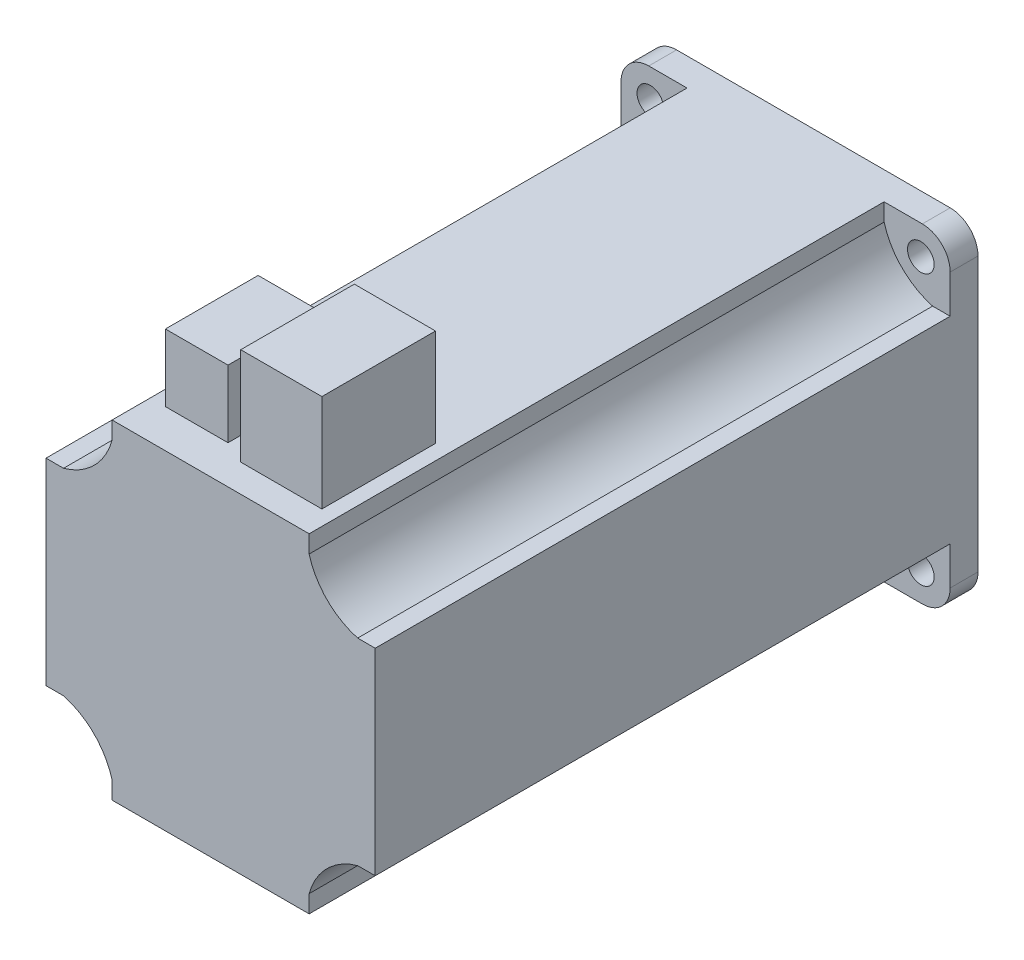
ISO-10303-21;
HEADER;
FILE_DESCRIPTION(('STEP AP214'),'2;1');
FILE_NAME('part.step','',(''),(''),'','','');
FILE_SCHEMA(('AUTOMOTIVE_DESIGN { 1 0 10303 214 1 1 1 1 }'));
ENDSEC;
DATA;
#1=APPLICATION_CONTEXT('core data for automotive mechanical design processes');
#2=APPLICATION_PROTOCOL_DEFINITION('international standard','automotive_design',2000,#1);
#3=PRODUCT_CONTEXT('',#1,'mechanical');
#4=PRODUCT('Part','Part','',(#3));
#5=PRODUCT_RELATED_PRODUCT_CATEGORY('part','',(#4));
#6=PRODUCT_DEFINITION_FORMATION('','',#4);
#7=PRODUCT_DEFINITION_CONTEXT('part definition',#1,'design');
#8=PRODUCT_DEFINITION('design','',#6,#7);
#9=PRODUCT_DEFINITION_SHAPE('','',#8);
#10=(LENGTH_UNIT() NAMED_UNIT(*) SI_UNIT(.MILLI.,.METRE.));
#11=(NAMED_UNIT(*) PLANE_ANGLE_UNIT() SI_UNIT($,.RADIAN.));
#12=(NAMED_UNIT(*) SI_UNIT($,.STERADIAN.) SOLID_ANGLE_UNIT());
#13=UNCERTAINTY_MEASURE_WITH_UNIT(LENGTH_MEASURE(1.E-05),#10,'distance_accuracy_value','');
#14=(GEOMETRIC_REPRESENTATION_CONTEXT(3) GLOBAL_UNCERTAINTY_ASSIGNED_CONTEXT((#13)) GLOBAL_UNIT_ASSIGNED_CONTEXT((#10,
#11,#12)) REPRESENTATION_CONTEXT('',''));
#15=CARTESIAN_POINT('',(0.,0.,0.));
#16=DIRECTION('',(0.,0.,1.));
#17=DIRECTION('',(1.,0.,0.));
#18=AXIS2_PLACEMENT_3D('',#15,#16,#17);
#19=CARTESIAN_POINT('',(-59.,71.,260.));
#20=DIRECTION('',(0.,-1.,0.));
#21=DIRECTION('',(1.,0.,0.));
#22=AXIS2_PLACEMENT_3D('',#19,#20,#21);
#23=PLANE('',#22);
#24=DIRECTION('',(0.,0.,-1.));
#25=VECTOR('',#24,1.);
#26=CARTESIAN_POINT('',(35.9999999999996,71.,199.));
#27=LINE('',#26,#25);
#28=CARTESIAN_POINT('',(35.9999999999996,71.,248.));
#29=VERTEX_POINT('',#28);
#30=CARTESIAN_POINT('',(35.9999999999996,71.,199.));
#31=VERTEX_POINT('',#30);
#32=EDGE_CURVE('E264',#29,#31,#27,.T.);
#33=ORIENTED_EDGE('',*,*,#32,.F.);
#34=DIRECTION('',(1.,0.,0.));
#35=VECTOR('',#34,1.);
#36=CARTESIAN_POINT('',(35.9999999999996,71.,248.));
#37=LINE('',#36,#35);
#38=CARTESIAN_POINT('',(0.99999999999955,71.,248.));
#39=VERTEX_POINT('',#38);
#40=EDGE_CURVE('E279',#39,#29,#37,.T.);
#41=ORIENTED_EDGE('',*,*,#40,.F.);
#42=DIRECTION('',(0.,0.,1.));
#43=VECTOR('',#42,1.);
#44=CARTESIAN_POINT('',(0.999999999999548,71.,199.));
#45=LINE('',#44,#43);
#46=CARTESIAN_POINT('',(0.99999999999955,71.,199.));
#47=VERTEX_POINT('',#46);
#48=EDGE_CURVE('E276',#47,#39,#45,.T.);
#49=ORIENTED_EDGE('',*,*,#48,.F.);
#50=DIRECTION('',(-1.,0.,0.));
#51=VECTOR('',#50,1.);
#52=CARTESIAN_POINT('',(35.9999999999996,71.,199.));
#53=LINE('',#52,#51);
#54=EDGE_CURVE('E268',#31,#47,#53,.T.);
#55=ORIENTED_EDGE('',*,*,#54,.F.);
#56=EDGE_LOOP('',(#33,#41,#49,#55));
#57=FACE_BOUND('',#56,.T.);
#58=DIRECTION('',(0.,0.,-1.));
#59=VECTOR('',#58,1.);
#60=CARTESIAN_POINT('',(42.4999999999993,71.,260.));
#61=LINE('',#60,#59);
#62=CARTESIAN_POINT('',(42.4999999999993,71.,260.));
#63=VERTEX_POINT('',#62);
#64=CARTESIAN_POINT('',(42.4999999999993,71.,12.));
#65=VERTEX_POINT('',#64);
#66=EDGE_CURVE('E331',#63,#65,#61,.T.);
#67=ORIENTED_EDGE('',*,*,#66,.T.);
#68=DIRECTION('',(-1.,0.,0.));
#69=VECTOR('',#68,1.);
#70=CARTESIAN_POINT('',(58.9999999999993,71.,12.));
#71=LINE('',#70,#69);
#72=CARTESIAN_POINT('',(58.9999999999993,71.,12.));
#73=VERTEX_POINT('',#72);
#74=EDGE_CURVE('E318',#73,#65,#71,.T.);
#75=ORIENTED_EDGE('',*,*,#74,.F.);
#76=DIRECTION('',(0.,0.,-1.));
#77=VECTOR('',#76,1.);
#78=CARTESIAN_POINT('',(59.,71.,260.));
#79=LINE('',#78,#77);
#80=CARTESIAN_POINT('',(59.,71.,0.));
#81=VERTEX_POINT('',#80);
#82=EDGE_CURVE('E480',#73,#81,#79,.T.);
#83=ORIENTED_EDGE('',*,*,#82,.T.);
#84=DIRECTION('',(-1.,0.,0.));
#85=VECTOR('',#84,1.);
#86=CARTESIAN_POINT('',(-59.,71.,0.));
#87=LINE('',#86,#85);
#88=CARTESIAN_POINT('',(-59.,71.,0.));
#89=VERTEX_POINT('',#88);
#90=EDGE_CURVE('E464',#81,#89,#87,.T.);
#91=ORIENTED_EDGE('',*,*,#90,.T.);
#92=DIRECTION('',(0.,0.,-1.));
#93=VECTOR('',#92,1.);
#94=CARTESIAN_POINT('',(-59.,71.,260.));
#95=LINE('',#94,#93);
#96=CARTESIAN_POINT('',(-59.,71.,12.));
#97=VERTEX_POINT('',#96);
#98=EDGE_CURVE('E478',#97,#89,#95,.T.);
#99=ORIENTED_EDGE('',*,*,#98,.F.);
#100=DIRECTION('',(-1.,0.,0.));
#101=VECTOR('',#100,1.);
#102=CARTESIAN_POINT('',(-42.5,71.,12.));
#103=LINE('',#102,#101);
#104=CARTESIAN_POINT('',(-42.5,71.,12.));
#105=VERTEX_POINT('',#104);
#106=EDGE_CURVE('E407',#105,#97,#103,.T.);
#107=ORIENTED_EDGE('',*,*,#106,.F.);
#108=DIRECTION('',(0.,0.,-1.));
#109=VECTOR('',#108,1.);
#110=CARTESIAN_POINT('',(-42.5,71.,260.));
#111=LINE('',#110,#109);
#112=CARTESIAN_POINT('',(-42.5,71.,260.));
#113=VERTEX_POINT('',#112);
#114=EDGE_CURVE('E428',#113,#105,#111,.T.);
#115=ORIENTED_EDGE('',*,*,#114,.F.);
#116=DIRECTION('',(-1.,0.,0.));
#117=VECTOR('',#116,1.);
#118=CARTESIAN_POINT('',(-59.,71.,260.));
#119=LINE('',#118,#117);
#120=EDGE_CURVE('E476',#63,#113,#119,.T.);
#121=ORIENTED_EDGE('',*,*,#120,.F.);
#122=EDGE_LOOP('',(#67,#75,#83,#91,#99,#107,#115,#121));
#123=FACE_BOUND('',#122,.T.);
#124=DIRECTION('',(0.,0.,-1.));
#125=VECTOR('',#124,1.);
#126=CARTESIAN_POINT('',(-9.,71.,243.5));
#127=LINE('',#126,#125);
#128=CARTESIAN_POINT('',(-9.,71.,243.5));
#129=VERTEX_POINT('',#128);
#130=CARTESIAN_POINT('',(-9.,71.,213.));
#131=VERTEX_POINT('',#130);
#132=EDGE_CURVE('E248',#129,#131,#127,.T.);
#133=ORIENTED_EDGE('',*,*,#132,.F.);
#134=DIRECTION('',(1.,0.,0.));
#135=VECTOR('',#134,1.);
#136=CARTESIAN_POINT('',(-9.,71.,243.5));
#137=LINE('',#136,#135);
#138=CARTESIAN_POINT('',(-36.,71.,243.5));
#139=VERTEX_POINT('',#138);
#140=EDGE_CURVE('E1007',#139,#129,#137,.T.);
#141=ORIENTED_EDGE('',*,*,#140,.F.);
#142=DIRECTION('',(0.,0.,1.));
#143=VECTOR('',#142,1.);
#144=CARTESIAN_POINT('',(-36.,71.,243.5));
#145=LINE('',#144,#143);
#146=CARTESIAN_POINT('',(-36.,71.,213.));
#147=VERTEX_POINT('',#146);
#148=EDGE_CURVE('E37',#147,#139,#145,.T.);
#149=ORIENTED_EDGE('',*,*,#148,.F.);
#150=DIRECTION('',(-1.,0.,0.));
#151=VECTOR('',#150,1.);
#152=CARTESIAN_POINT('',(71.001,71.,213.));
#153=LINE('',#152,#151);
#154=EDGE_CURVE('E1000',#131,#147,#153,.T.);
#155=ORIENTED_EDGE('',*,*,#154,.F.);
#156=EDGE_LOOP('',(#133,#141,#149,#155));
#157=FACE_BOUND('',#156,.T.);
#158=ADVANCED_FACE('F15',(#57,#123,#157),#23,.F.);
#159=CARTESIAN_POINT('',(-59.,59.,260.));
#160=DIRECTION('',(0.,0.,-1.));
#161=DIRECTION('',(-1.,0.,0.));
#162=AXIS2_PLACEMENT_3D('',#159,#160,#161);
#163=PLANE('',#162);
#164=DIRECTION('',(1.,0.,0.));
#165=VECTOR('',#164,1.);
#166=CARTESIAN_POINT('',(71.,42.5000000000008,260.));
#167=LINE('',#166,#165);
#168=CARTESIAN_POINT('',(63.4326915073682,42.5000000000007,260.));
#169=VERTEX_POINT('',#168);
#170=CARTESIAN_POINT('',(71.,42.5000000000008,260.));
#171=VERTEX_POINT('',#170);
#172=EDGE_CURVE('E324',#169,#171,#167,.T.);
#173=ORIENTED_EDGE('',*,*,#172,.F.);
#174=CARTESIAN_POINT('',(71.4177848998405,71.4177848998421,260.));
#175=DIRECTION('',(0.,0.,1.));
#176=DIRECTION('',(0.,-1.,0.));
#177=AXIS2_PLACEMENT_3D('',#174,#175,#176);
#178=CIRCLE('',#177,30.);
#179=CARTESIAN_POINT('',(42.4999999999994,63.4326915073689,260.));
#180=VERTEX_POINT('',#179);
#181=EDGE_CURVE('E322',#180,#169,#178,.T.);
#182=ORIENTED_EDGE('',*,*,#181,.F.);
#183=DIRECTION('',(0.,-1.,0.));
#184=VECTOR('',#183,1.);
#185=CARTESIAN_POINT('',(42.4999999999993,71.,260.));
#186=LINE('',#185,#184);
#187=EDGE_CURVE('E326',#63,#180,#186,.T.);
#188=ORIENTED_EDGE('',*,*,#187,.F.);
#189=ORIENTED_EDGE('',*,*,#120,.T.);
#190=DIRECTION('',(0.,1.,0.));
#191=VECTOR('',#190,1.);
#192=CARTESIAN_POINT('',(-42.5,71.,260.));
#193=LINE('',#192,#191);
#194=CARTESIAN_POINT('',(-42.5,63.4326915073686,260.));
#195=VERTEX_POINT('',#194);
#196=EDGE_CURVE('E417',#195,#113,#193,.T.);
#197=ORIENTED_EDGE('',*,*,#196,.F.);
#198=CARTESIAN_POINT('',(-71.4177848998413,71.4177848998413,260.));
#199=DIRECTION('',(0.,0.,1.));
#200=DIRECTION('',(1.,0.,0.));
#201=AXIS2_PLACEMENT_3D('',#198,#199,#200);
#202=CIRCLE('',#201,30.);
#203=CARTESIAN_POINT('',(-63.4326915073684,42.5,260.));
#204=VERTEX_POINT('',#203);
#205=EDGE_CURVE('E415',#204,#195,#202,.T.);
#206=ORIENTED_EDGE('',*,*,#205,.F.);
#207=DIRECTION('',(1.,0.,0.));
#208=VECTOR('',#207,1.);
#209=CARTESIAN_POINT('',(-71.,42.5,260.));
#210=LINE('',#209,#208);
#211=CARTESIAN_POINT('',(-71.,42.5,260.));
#212=VERTEX_POINT('',#211);
#213=EDGE_CURVE('E420',#212,#204,#210,.T.);
#214=ORIENTED_EDGE('',*,*,#213,.F.);
#215=DIRECTION('',(0.,-1.,0.));
#216=VECTOR('',#215,1.);
#217=CARTESIAN_POINT('',(-71.,59.,260.));
#218=LINE('',#217,#216);
#219=CARTESIAN_POINT('',(-71.,-42.5,260.));
#220=VERTEX_POINT('',#219);
#221=EDGE_CURVE('E467',#212,#220,#218,.T.);
#222=ORIENTED_EDGE('',*,*,#221,.T.);
#223=DIRECTION('',(-1.,0.,0.));
#224=VECTOR('',#223,1.);
#225=CARTESIAN_POINT('',(-71.,-42.5,260.));
#226=LINE('',#225,#224);
#227=CARTESIAN_POINT('',(-63.4326915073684,-42.5,260.));
#228=VERTEX_POINT('',#227);
#229=EDGE_CURVE('E386',#228,#220,#226,.T.);
#230=ORIENTED_EDGE('',*,*,#229,.F.);
#231=CARTESIAN_POINT('',(-71.417784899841,-71.4177848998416,260.));
#232=DIRECTION('',(0.,0.,1.));
#233=DIRECTION('',(0.,1.,0.));
#234=AXIS2_PLACEMENT_3D('',#231,#232,#233);
#235=CIRCLE('',#234,30.);
#236=CARTESIAN_POINT('',(-42.5,-63.4326915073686,260.));
#237=VERTEX_POINT('',#236);
#238=EDGE_CURVE('E384',#237,#228,#235,.T.);
#239=ORIENTED_EDGE('',*,*,#238,.F.);
#240=DIRECTION('',(0.,1.,0.));
#241=VECTOR('',#240,1.);
#242=CARTESIAN_POINT('',(-42.5,-71.,260.));
#243=LINE('',#242,#241);
#244=CARTESIAN_POINT('',(-42.5,-71.,260.));
#245=VERTEX_POINT('',#244);
#246=EDGE_CURVE('E388',#245,#237,#243,.T.);
#247=ORIENTED_EDGE('',*,*,#246,.F.);
#248=DIRECTION('',(1.,0.,0.));
#249=VECTOR('',#248,1.);
#250=CARTESIAN_POINT('',(-59.,-71.,260.));
#251=LINE('',#250,#249);
#252=CARTESIAN_POINT('',(42.5000000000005,-71.,260.));
#253=VERTEX_POINT('',#252);
#254=EDGE_CURVE('E470',#245,#253,#251,.T.);
#255=ORIENTED_EDGE('',*,*,#254,.T.);
#256=DIRECTION('',(0.,-1.,0.));
#257=VECTOR('',#256,1.);
#258=CARTESIAN_POINT('',(42.5000000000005,-71.,260.));
#259=LINE('',#258,#257);
#260=CARTESIAN_POINT('',(42.5000000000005,-63.4326915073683,260.));
#261=VERTEX_POINT('',#260);
#262=EDGE_CURVE('E355',#261,#253,#259,.T.);
#263=ORIENTED_EDGE('',*,*,#262,.F.);
#264=CARTESIAN_POINT('',(71.4177848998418,-71.4177848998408,260.));
#265=DIRECTION('',(0.,0.,1.));
#266=DIRECTION('',(-1.,0.,0.));
#267=AXIS2_PLACEMENT_3D('',#264,#265,#266);
#268=CIRCLE('',#267,30.);
#269=CARTESIAN_POINT('',(63.4326915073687,-42.5,260.));
#270=VERTEX_POINT('',#269);
#271=EDGE_CURVE('E353',#270,#261,#268,.T.);
#272=ORIENTED_EDGE('',*,*,#271,.F.);
#273=DIRECTION('',(-1.,0.,0.));
#274=VECTOR('',#273,1.);
#275=CARTESIAN_POINT('',(71.,-42.4999999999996,260.));
#276=LINE('',#275,#274);
#277=CARTESIAN_POINT('',(71.,-42.4999999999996,260.));
#278=VERTEX_POINT('',#277);
#279=EDGE_CURVE('E357',#278,#270,#276,.T.);
#280=ORIENTED_EDGE('',*,*,#279,.F.);
#281=DIRECTION('',(0.,1.,0.));
#282=VECTOR('',#281,1.);
#283=CARTESIAN_POINT('',(71.,59.,260.));
#284=LINE('',#283,#282);
#285=EDGE_CURVE('E473',#278,#171,#284,.T.);
#286=ORIENTED_EDGE('',*,*,#285,.T.);
#287=EDGE_LOOP('',(#173,#182,#188,#189,#197,#206,#214,#222,#230,#239,#247,#255,#263,#272,#280,#286));
#288=FACE_BOUND('',#287,.T.);
#289=ADVANCED_FACE('F551',(#288),#163,.F.);
#290=CARTESIAN_POINT('',(71.,59.,260.));
#291=DIRECTION('',(-1.,0.,0.));
#292=DIRECTION('',(0.,-1.,0.));
#293=AXIS2_PLACEMENT_3D('',#290,#291,#292);
#294=PLANE('',#293);
#295=DIRECTION('',(0.,0.,-1.));
#296=VECTOR('',#295,1.);
#297=CARTESIAN_POINT('',(71.,42.5000000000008,260.));
#298=LINE('',#297,#296);
#299=CARTESIAN_POINT('',(71.,42.5000000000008,12.));
#300=VERTEX_POINT('',#299);
#301=EDGE_CURVE('E334',#171,#300,#298,.T.);
#302=ORIENTED_EDGE('',*,*,#301,.F.);
#303=ORIENTED_EDGE('',*,*,#285,.F.);
#304=DIRECTION('',(0.,0.,-1.));
#305=VECTOR('',#304,1.);
#306=CARTESIAN_POINT('',(71.,-42.4999999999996,260.));
#307=LINE('',#306,#305);
#308=CARTESIAN_POINT('',(71.,-42.4999999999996,12.));
#309=VERTEX_POINT('',#308);
#310=EDGE_CURVE('E362',#278,#309,#307,.T.);
#311=ORIENTED_EDGE('',*,*,#310,.T.);
#312=DIRECTION('',(0.,1.,0.));
#313=VECTOR('',#312,1.);
#314=CARTESIAN_POINT('',(71.,-59.,12.));
#315=LINE('',#314,#313);
#316=CARTESIAN_POINT('',(71.,-59.,12.));
#317=VERTEX_POINT('',#316);
#318=EDGE_CURVE('E349',#317,#309,#315,.T.);
#319=ORIENTED_EDGE('',*,*,#318,.F.);
#320=DIRECTION('',(0.,0.,-1.));
#321=VECTOR('',#320,1.);
#322=CARTESIAN_POINT('',(71.,-59.,260.));
#323=LINE('',#322,#321);
#324=CARTESIAN_POINT('',(71.,-59.,0.));
#325=VERTEX_POINT('',#324);
#326=EDGE_CURVE('E484',#317,#325,#323,.T.);
#327=ORIENTED_EDGE('',*,*,#326,.T.);
#328=DIRECTION('',(0.,1.,0.));
#329=VECTOR('',#328,1.);
#330=CARTESIAN_POINT('',(71.,59.,0.));
#331=LINE('',#330,#329);
#332=CARTESIAN_POINT('',(71.,59.,0.));
#333=VERTEX_POINT('',#332);
#334=EDGE_CURVE('E458',#325,#333,#331,.T.);
#335=ORIENTED_EDGE('',*,*,#334,.T.);
#336=DIRECTION('',(0.,0.,-1.));
#337=VECTOR('',#336,1.);
#338=CARTESIAN_POINT('',(71.,59.,260.));
#339=LINE('',#338,#337);
#340=CARTESIAN_POINT('',(71.,59.,12.));
#341=VERTEX_POINT('',#340);
#342=EDGE_CURVE('E482',#341,#333,#339,.T.);
#343=ORIENTED_EDGE('',*,*,#342,.F.);
#344=DIRECTION('',(0.,1.,0.));
#345=VECTOR('',#344,1.);
#346=CARTESIAN_POINT('',(71.,42.5000000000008,12.));
#347=LINE('',#346,#345);
#348=EDGE_CURVE('E314',#300,#341,#347,.T.);
#349=ORIENTED_EDGE('',*,*,#348,.F.);
#350=EDGE_LOOP('',(#302,#303,#311,#319,#327,#335,#343,#349));
#351=FACE_BOUND('',#350,.T.);
#352=ADVANCED_FACE('F523',(#351),#294,.F.);
#353=CARTESIAN_POINT('',(59.,59.,260.));
#354=DIRECTION('',(0.,0.,-1.));
#355=DIRECTION('',(-1.,0.,0.));
#356=AXIS2_PLACEMENT_3D('',#353,#354,#355);
#357=CYLINDRICAL_SURFACE('',#356,12.);
#358=CARTESIAN_POINT('',(59.,59.,12.));
#359=DIRECTION('',(0.,0.,1.));
#360=DIRECTION('',(0.,-1.,0.));
#361=AXIS2_PLACEMENT_3D('',#358,#359,#360);
#362=CIRCLE('',#361,12.);
#363=EDGE_CURVE('E316',#341,#73,#362,.T.);
#364=ORIENTED_EDGE('',*,*,#363,.F.);
#365=ORIENTED_EDGE('',*,*,#342,.T.);
#366=CARTESIAN_POINT('',(59.,59.,0.));
#367=DIRECTION('',(0.,0.,1.));
#368=DIRECTION('',(-1.,0.,0.));
#369=AXIS2_PLACEMENT_3D('',#366,#367,#368);
#370=CIRCLE('',#369,12.);
#371=EDGE_CURVE('E461',#333,#81,#370,.T.);
#372=ORIENTED_EDGE('',*,*,#371,.T.);
#373=ORIENTED_EDGE('',*,*,#82,.F.);
#374=EDGE_LOOP('',(#364,#365,#372,#373));
#375=FACE_BOUND('',#374,.T.);
#376=ADVANCED_FACE('F518',(#375),#357,.T.);
#377=CARTESIAN_POINT('',(-59.,-71.,260.));
#378=DIRECTION('',(0.,1.,0.));
#379=DIRECTION('',(-1.,0.,0.));
#380=AXIS2_PLACEMENT_3D('',#377,#378,#379);
#381=PLANE('',#380);
#382=DIRECTION('',(0.,0.,-1.));
#383=VECTOR('',#382,1.);
#384=CARTESIAN_POINT('',(42.5000000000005,-71.,260.));
#385=LINE('',#384,#383);
#386=CARTESIAN_POINT('',(42.5000000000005,-71.,12.));
#387=VERTEX_POINT('',#386);
#388=EDGE_CURVE('E365',#253,#387,#385,.T.);
#389=ORIENTED_EDGE('',*,*,#388,.F.);
#390=ORIENTED_EDGE('',*,*,#254,.F.);
#391=DIRECTION('',(0.,0.,-1.));
#392=VECTOR('',#391,1.);
#393=CARTESIAN_POINT('',(-42.5,-71.,260.));
#394=LINE('',#393,#392);
#395=CARTESIAN_POINT('',(-42.5,-71.,12.));
#396=VERTEX_POINT('',#395);
#397=EDGE_CURVE('E393',#245,#396,#394,.T.);
#398=ORIENTED_EDGE('',*,*,#397,.T.);
#399=DIRECTION('',(1.,0.,0.));
#400=VECTOR('',#399,1.);
#401=CARTESIAN_POINT('',(-59.,-71.,12.));
#402=LINE('',#401,#400);
#403=CARTESIAN_POINT('',(-59.,-71.,12.));
#404=VERTEX_POINT('',#403);
#405=EDGE_CURVE('E380',#404,#396,#402,.T.);
#406=ORIENTED_EDGE('',*,*,#405,.F.);
#407=DIRECTION('',(0.,0.,-1.));
#408=VECTOR('',#407,1.);
#409=CARTESIAN_POINT('',(-59.,-71.,260.));
#410=LINE('',#409,#408);
#411=CARTESIAN_POINT('',(-59.,-71.,0.));
#412=VERTEX_POINT('',#411);
#413=EDGE_CURVE('E488',#404,#412,#410,.T.);
#414=ORIENTED_EDGE('',*,*,#413,.T.);
#415=DIRECTION('',(1.,0.,0.));
#416=VECTOR('',#415,1.);
#417=CARTESIAN_POINT('',(-59.,-71.,0.));
#418=LINE('',#417,#416);
#419=CARTESIAN_POINT('',(59.,-71.,0.));
#420=VERTEX_POINT('',#419);
#421=EDGE_CURVE('E452',#412,#420,#418,.T.);
#422=ORIENTED_EDGE('',*,*,#421,.T.);
#423=DIRECTION('',(0.,0.,-1.));
#424=VECTOR('',#423,1.);
#425=CARTESIAN_POINT('',(59.,-71.,260.));
#426=LINE('',#425,#424);
#427=CARTESIAN_POINT('',(59.,-71.,12.));
#428=VERTEX_POINT('',#427);
#429=EDGE_CURVE('E486',#428,#420,#426,.T.);
#430=ORIENTED_EDGE('',*,*,#429,.F.);
#431=DIRECTION('',(1.,0.,0.));
#432=VECTOR('',#431,1.);
#433=CARTESIAN_POINT('',(42.5000000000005,-71.,12.));
#434=LINE('',#433,#432);
#435=EDGE_CURVE('E345',#387,#428,#434,.T.);
#436=ORIENTED_EDGE('',*,*,#435,.F.);
#437=EDGE_LOOP('',(#389,#390,#398,#406,#414,#422,#430,#436));
#438=FACE_BOUND('',#437,.T.);
#439=ADVANCED_FACE('F532',(#438),#381,.F.);
#440=CARTESIAN_POINT('',(59.,-59.,260.));
#441=DIRECTION('',(0.,0.,-1.));
#442=DIRECTION('',(-1.,0.,0.));
#443=AXIS2_PLACEMENT_3D('',#440,#441,#442);
#444=CYLINDRICAL_SURFACE('',#443,12.);
#445=CARTESIAN_POINT('',(59.,-59.,12.));
#446=DIRECTION('',(0.,0.,1.));
#447=DIRECTION('',(-1.,0.,0.));
#448=AXIS2_PLACEMENT_3D('',#445,#446,#447);
#449=CIRCLE('',#448,12.);
#450=EDGE_CURVE('E347',#428,#317,#449,.T.);
#451=ORIENTED_EDGE('',*,*,#450,.F.);
#452=ORIENTED_EDGE('',*,*,#429,.T.);
#453=CARTESIAN_POINT('',(59.,-59.,0.));
#454=DIRECTION('',(0.,0.,1.));
#455=DIRECTION('',(-1.,0.,0.));
#456=AXIS2_PLACEMENT_3D('',#453,#454,#455);
#457=CIRCLE('',#456,12.);
#458=EDGE_CURVE('E455',#420,#325,#457,.T.);
#459=ORIENTED_EDGE('',*,*,#458,.T.);
#460=ORIENTED_EDGE('',*,*,#326,.F.);
#461=EDGE_LOOP('',(#451,#452,#459,#460));
#462=FACE_BOUND('',#461,.T.);
#463=ADVANCED_FACE('F528',(#462),#444,.T.);
#464=CARTESIAN_POINT('',(-71.,59.,260.));
#465=DIRECTION('',(1.,0.,0.));
#466=DIRECTION('',(0.,0.,-1.));
#467=AXIS2_PLACEMENT_3D('',#464,#465,#466);
#468=PLANE('',#467);
#469=DIRECTION('',(0.,0.,-1.));
#470=VECTOR('',#469,1.);
#471=CARTESIAN_POINT('',(-71.,-42.5,260.));
#472=LINE('',#471,#470);
#473=CARTESIAN_POINT('',(-71.,-42.5,12.));
#474=VERTEX_POINT('',#473);
#475=EDGE_CURVE('E396',#220,#474,#472,.T.);
#476=ORIENTED_EDGE('',*,*,#475,.F.);
#477=ORIENTED_EDGE('',*,*,#221,.F.);
#478=DIRECTION('',(0.,0.,-1.));
#479=VECTOR('',#478,1.);
#480=CARTESIAN_POINT('',(-71.,42.5,260.));
#481=LINE('',#480,#479);
#482=CARTESIAN_POINT('',(-71.,42.5,12.));
#483=VERTEX_POINT('',#482);
#484=EDGE_CURVE('E425',#212,#483,#481,.T.);
#485=ORIENTED_EDGE('',*,*,#484,.T.);
#486=DIRECTION('',(0.,-1.,0.));
#487=VECTOR('',#486,1.);
#488=CARTESIAN_POINT('',(-71.,59.,12.));
#489=LINE('',#488,#487);
#490=CARTESIAN_POINT('',(-71.,59.,12.));
#491=VERTEX_POINT('',#490);
#492=EDGE_CURVE('E411',#491,#483,#489,.T.);
#493=ORIENTED_EDGE('',*,*,#492,.F.);
#494=DIRECTION('',(0.,0.,-1.));
#495=VECTOR('',#494,1.);
#496=CARTESIAN_POINT('',(-71.,59.,260.));
#497=LINE('',#496,#495);
#498=CARTESIAN_POINT('',(-71.,59.,0.));
#499=VERTEX_POINT('',#498);
#500=EDGE_CURVE('E23',#491,#499,#497,.T.);
#501=ORIENTED_EDGE('',*,*,#500,.T.);
#502=DIRECTION('',(0.,-1.,0.));
#503=VECTOR('',#502,1.);
#504=CARTESIAN_POINT('',(-71.,59.,0.));
#505=LINE('',#504,#503);
#506=CARTESIAN_POINT('',(-71.,-59.,0.));
#507=VERTEX_POINT('',#506);
#508=EDGE_CURVE('E446',#499,#507,#505,.T.);
#509=ORIENTED_EDGE('',*,*,#508,.T.);
#510=DIRECTION('',(0.,0.,-1.));
#511=VECTOR('',#510,1.);
#512=CARTESIAN_POINT('',(-71.,-59.,260.));
#513=LINE('',#512,#511);
#514=CARTESIAN_POINT('',(-71.,-59.,12.));
#515=VERTEX_POINT('',#514);
#516=EDGE_CURVE('E490',#515,#507,#513,.T.);
#517=ORIENTED_EDGE('',*,*,#516,.F.);
#518=DIRECTION('',(0.,-1.,0.));
#519=VECTOR('',#518,1.);
#520=CARTESIAN_POINT('',(-71.,-42.5,12.));
#521=LINE('',#520,#519);
#522=EDGE_CURVE('E376',#474,#515,#521,.T.);
#523=ORIENTED_EDGE('',*,*,#522,.F.);
#524=EDGE_LOOP('',(#476,#477,#485,#493,#501,#509,#517,#523));
#525=FACE_BOUND('',#524,.T.);
#526=ADVANCED_FACE('F496',(#525),#468,.F.);
#527=CARTESIAN_POINT('',(-59.,-59.,260.));
#528=DIRECTION('',(0.,0.,-1.));
#529=DIRECTION('',(-1.,0.,0.));
#530=AXIS2_PLACEMENT_3D('',#527,#528,#529);
#531=CYLINDRICAL_SURFACE('',#530,12.);
#532=CARTESIAN_POINT('',(-59.,-59.,12.));
#533=DIRECTION('',(0.,0.,1.));
#534=DIRECTION('',(0.,1.,0.));
#535=AXIS2_PLACEMENT_3D('',#532,#533,#534);
#536=CIRCLE('',#535,12.);
#537=EDGE_CURVE('E378',#515,#404,#536,.T.);
#538=ORIENTED_EDGE('',*,*,#537,.F.);
#539=ORIENTED_EDGE('',*,*,#516,.T.);
#540=CARTESIAN_POINT('',(-59.,-59.,0.));
#541=DIRECTION('',(0.,0.,1.));
#542=DIRECTION('',(-1.,0.,0.));
#543=AXIS2_PLACEMENT_3D('',#540,#541,#542);
#544=CIRCLE('',#543,12.);
#545=EDGE_CURVE('E449',#507,#412,#544,.T.);
#546=ORIENTED_EDGE('',*,*,#545,.T.);
#547=ORIENTED_EDGE('',*,*,#413,.F.);
#548=EDGE_LOOP('',(#538,#539,#546,#547));
#549=FACE_BOUND('',#548,.T.);
#550=ADVANCED_FACE('F538',(#549),#531,.T.);
#551=CARTESIAN_POINT('',(-59.,59.,260.));
#552=DIRECTION('',(0.,0.,-1.));
#553=DIRECTION('',(-1.,0.,0.));
#554=AXIS2_PLACEMENT_3D('',#551,#552,#553);
#555=CYLINDRICAL_SURFACE('',#554,12.);
#556=CARTESIAN_POINT('',(-59.,59.,12.));
#557=DIRECTION('',(0.,0.,1.));
#558=DIRECTION('',(1.,0.,0.));
#559=AXIS2_PLACEMENT_3D('',#556,#557,#558);
#560=CIRCLE('',#559,12.);
#561=EDGE_CURVE('E409',#97,#491,#560,.T.);
#562=ORIENTED_EDGE('',*,*,#561,.F.);
#563=ORIENTED_EDGE('',*,*,#98,.T.);
#564=CARTESIAN_POINT('',(-59.,59.,0.));
#565=DIRECTION('',(0.,0.,1.));
#566=DIRECTION('',(-1.,0.,0.));
#567=AXIS2_PLACEMENT_3D('',#564,#565,#566);
#568=CIRCLE('',#567,12.);
#569=EDGE_CURVE('E443',#89,#499,#568,.T.);
#570=ORIENTED_EDGE('',*,*,#569,.T.);
#571=ORIENTED_EDGE('',*,*,#500,.F.);
#572=EDGE_LOOP('',(#562,#563,#570,#571));
#573=FACE_BOUND('',#572,.T.);
#574=ADVANCED_FACE('F17',(#573),#555,.T.);
#575=CARTESIAN_POINT('',(-59.,59.,0.));
#576=DIRECTION('',(0.,0.,-1.));
#577=DIRECTION('',(-1.,0.,0.));
#578=AXIS2_PLACEMENT_3D('',#575,#576,#577);
#579=PLANE('',#578);
#580=CARTESIAN_POINT('',(0.,0.,0.));
#581=DIRECTION('',(0.,0.,-1.));
#582=DIRECTION('',(-1.,0.,0.));
#583=AXIS2_PLACEMENT_3D('',#580,#581,#582);
#584=CIRCLE('',#583,60.);
#585=CARTESIAN_POINT('',(-60.,0.,0.));
#586=VERTEX_POINT('',#585);
#587=EDGE_CURVE('E10',#586,#586,#584,.F.);
#588=ORIENTED_EDGE('',*,*,#587,.F.);
#589=EDGE_LOOP('',(#588));
#590=FACE_BOUND('',#589,.T.);
#591=ADVANCED_FACE('F655',(#590),#579,.T.);
#592=CARTESIAN_POINT('',(58.3363094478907,-58.3363094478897,0.));
#593=DIRECTION('',(0.,0.,-1.));
#594=DIRECTION('',(-1.,0.,0.));
#595=AXIS2_PLACEMENT_3D('',#592,#593,#594);
#596=CIRCLE('',#595,5.75);
#597=CARTESIAN_POINT('',(52.5863094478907,-58.3363094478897,0.));
#598=VERTEX_POINT('',#597);
#599=EDGE_CURVE('E981',#598,#598,#596,.T.);
#600=ORIENTED_EDGE('',*,*,#599,.F.);
#601=EDGE_LOOP('',(#600));
#602=FACE_BOUND('',#601,.T.);
#603=CARTESIAN_POINT('',(-58.3363094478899,-58.3363094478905,0.));
#604=DIRECTION('',(0.,0.,-1.));
#605=DIRECTION('',(-1.,0.,0.));
#606=AXIS2_PLACEMENT_3D('',#603,#604,#605);
#607=CIRCLE('',#606,5.75);
#608=CARTESIAN_POINT('',(-64.0863094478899,-58.3363094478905,0.));
#609=VERTEX_POINT('',#608);
#610=EDGE_CURVE('E985',#609,#609,#607,.T.);
#611=ORIENTED_EDGE('',*,*,#610,.F.);
#612=EDGE_LOOP('',(#611));
#613=FACE_BOUND('',#612,.T.);
#614=CARTESIAN_POINT('',(-58.3363094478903,58.3363094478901,0.));
#615=DIRECTION('',(0.,0.,-1.));
#616=DIRECTION('',(-1.,0.,0.));
#617=AXIS2_PLACEMENT_3D('',#614,#615,#616);
#618=CIRCLE('',#617,5.75);
#619=CARTESIAN_POINT('',(-64.0863094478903,58.3363094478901,0.));
#620=VERTEX_POINT('',#619);
#621=EDGE_CURVE('E994',#620,#620,#618,.T.);
#622=ORIENTED_EDGE('',*,*,#621,.F.);
#623=EDGE_LOOP('',(#622));
#624=FACE_BOUND('',#623,.T.);
#625=CARTESIAN_POINT('',(58.3363094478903,58.3363094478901,0.));
#626=DIRECTION('',(0.,0.,-1.));
#627=DIRECTION('',(-1.,0.,0.));
#628=AXIS2_PLACEMENT_3D('',#625,#626,#627);
#629=CIRCLE('',#628,5.75);
#630=CARTESIAN_POINT('',(52.5863094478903,58.3363094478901,0.));
#631=VERTEX_POINT('',#630);
#632=EDGE_CURVE('E303',#631,#631,#629,.T.);
#633=ORIENTED_EDGE('',*,*,#632,.F.);
#634=EDGE_LOOP('',(#633));
#635=FACE_BOUND('',#634,.T.);
#636=ORIENTED_EDGE('',*,*,#569,.F.);
#637=ORIENTED_EDGE('',*,*,#90,.F.);
#638=ORIENTED_EDGE('',*,*,#371,.F.);
#639=ORIENTED_EDGE('',*,*,#334,.F.);
#640=ORIENTED_EDGE('',*,*,#458,.F.);
#641=ORIENTED_EDGE('',*,*,#421,.F.);
#642=ORIENTED_EDGE('',*,*,#545,.F.);
#643=ORIENTED_EDGE('',*,*,#508,.F.);
#644=EDGE_LOOP('',(#636,#637,#638,#639,#640,#641,#642,#643));
#645=FACE_BOUND('',#644,.T.);
#646=CARTESIAN_POINT('',(0.,0.,0.));
#647=DIRECTION('',(0.,0.,-1.));
#648=DIRECTION('',(-1.,0.,0.));
#649=AXIS2_PLACEMENT_3D('',#646,#647,#648);
#650=CIRCLE('',#649,65.);
#651=CARTESIAN_POINT('',(-65.,0.,0.));
#652=VERTEX_POINT('',#651);
#653=EDGE_CURVE('E437',#652,#652,#650,.T.);
#654=ORIENTED_EDGE('',*,*,#653,.F.);
#655=EDGE_LOOP('',(#654));
#656=FACE_BOUND('',#655,.T.);
#657=ADVANCED_FACE('F503',(#602,#613,#624,#635,#645,#656),#579,.T.);
#658=CARTESIAN_POINT('',(0.,0.,-3.5));
#659=DIRECTION('',(0.,0.,-1.));
#660=DIRECTION('',(-1.,0.,0.));
#661=AXIS2_PLACEMENT_3D('',#658,#659,#660);
#662=PLANE('',#661);
#663=CARTESIAN_POINT('',(0.,0.,-3.5));
#664=DIRECTION('',(0.,0.,-1.));
#665=DIRECTION('',(-1.,0.,0.));
#666=AXIS2_PLACEMENT_3D('',#663,#664,#665);
#667=CIRCLE('',#666,65.);
#668=CARTESIAN_POINT('',(-65.,0.,-3.5));
#669=VERTEX_POINT('',#668);
#670=EDGE_CURVE('E440',#669,#669,#667,.T.);
#671=ORIENTED_EDGE('',*,*,#670,.T.);
#672=EDGE_LOOP('',(#671));
#673=FACE_BOUND('',#672,.T.);
#674=CARTESIAN_POINT('',(0.,0.,-3.5));
#675=DIRECTION('',(0.,0.,-1.));
#676=DIRECTION('',(-1.,0.,0.));
#677=AXIS2_PLACEMENT_3D('',#674,#675,#676);
#678=CIRCLE('',#677,60.);
#679=CARTESIAN_POINT('',(-60.,0.,-3.5));
#680=VERTEX_POINT('',#679);
#681=EDGE_CURVE('E434',#680,#680,#678,.T.);
#682=ORIENTED_EDGE('',*,*,#681,.F.);
#683=EDGE_LOOP('',(#682));
#684=FACE_BOUND('',#683,.T.);
#685=ADVANCED_FACE('F669',(#673,#684),#662,.T.);
#686=CARTESIAN_POINT('',(0.,0.,-3.5));
#687=DIRECTION('',(0.,0.,1.));
#688=DIRECTION('',(1.,0.,0.));
#689=AXIS2_PLACEMENT_3D('',#686,#687,#688);
#690=CYLINDRICAL_SURFACE('',#689,65.);
#691=ORIENTED_EDGE('',*,*,#670,.F.);
#692=EDGE_LOOP('',(#691));
#693=FACE_BOUND('',#692,.T.);
#694=ORIENTED_EDGE('',*,*,#653,.T.);
#695=EDGE_LOOP('',(#694));
#696=FACE_BOUND('',#695,.T.);
#697=ADVANCED_FACE('F677',(#693,#696),#690,.T.);
#698=CARTESIAN_POINT('',(0.,0.,-3.5));
#699=DIRECTION('',(0.,0.,1.));
#700=DIRECTION('',(1.,0.,0.));
#701=AXIS2_PLACEMENT_3D('',#698,#699,#700);
#702=CYLINDRICAL_SURFACE('',#701,60.);
#703=ORIENTED_EDGE('',*,*,#681,.T.);
#704=EDGE_LOOP('',(#703));
#705=FACE_BOUND('',#704,.T.);
#706=ORIENTED_EDGE('',*,*,#587,.T.);
#707=EDGE_LOOP('',(#706));
#708=FACE_BOUND('',#707,.T.);
#709=ADVANCED_FACE('F686',(#705,#708),#702,.F.);
#710=CARTESIAN_POINT('',(-71.4177848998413,71.4177848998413,260.));
#711=DIRECTION('',(0.,0.,-1.));
#712=DIRECTION('',(-1.,0.,0.));
#713=AXIS2_PLACEMENT_3D('',#710,#711,#712);
#714=CYLINDRICAL_SURFACE('',#713,30.);
#715=CARTESIAN_POINT('',(-71.4177848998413,71.4177848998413,12.));
#716=DIRECTION('',(0.,0.,1.));
#717=DIRECTION('',(1.,0.,0.));
#718=AXIS2_PLACEMENT_3D('',#715,#716,#717);
#719=CIRCLE('',#718,30.);
#720=CARTESIAN_POINT('',(-63.4326915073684,42.5,12.));
#721=VERTEX_POINT('',#720);
#722=CARTESIAN_POINT('',(-42.5,63.4326915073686,12.));
#723=VERTEX_POINT('',#722);
#724=EDGE_CURVE('E402',#721,#723,#719,.T.);
#725=ORIENTED_EDGE('',*,*,#724,.F.);
#726=DIRECTION('',(0.,0.,-1.));
#727=VECTOR('',#726,1.);
#728=CARTESIAN_POINT('',(-63.4326915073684,42.5,260.));
#729=LINE('',#728,#727);
#730=EDGE_CURVE('E422',#204,#721,#729,.T.);
#731=ORIENTED_EDGE('',*,*,#730,.F.);
#732=ORIENTED_EDGE('',*,*,#205,.T.);
#733=DIRECTION('',(0.,0.,-1.));
#734=VECTOR('',#733,1.);
#735=CARTESIAN_POINT('',(-42.5,63.4326915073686,260.));
#736=LINE('',#735,#734);
#737=EDGE_CURVE('E431',#195,#723,#736,.T.);
#738=ORIENTED_EDGE('',*,*,#737,.T.);
#739=EDGE_LOOP('',(#725,#731,#732,#738));
#740=FACE_BOUND('',#739,.T.);
#741=ADVANCED_FACE('F695',(#740),#714,.F.);
#742=CARTESIAN_POINT('',(-42.5,71.,260.));
#743=DIRECTION('',(-1.,0.,0.));
#744=DIRECTION('',(0.,0.,1.));
#745=AXIS2_PLACEMENT_3D('',#742,#743,#744);
#746=PLANE('',#745);
#747=DIRECTION('',(0.,1.,0.));
#748=VECTOR('',#747,1.);
#749=CARTESIAN_POINT('',(-42.5,71.,12.));
#750=LINE('',#749,#748);
#751=EDGE_CURVE('E405',#723,#105,#750,.T.);
#752=ORIENTED_EDGE('',*,*,#751,.F.);
#753=ORIENTED_EDGE('',*,*,#737,.F.);
#754=ORIENTED_EDGE('',*,*,#196,.T.);
#755=ORIENTED_EDGE('',*,*,#114,.T.);
#756=EDGE_LOOP('',(#752,#753,#754,#755));
#757=FACE_BOUND('',#756,.T.);
#758=ADVANCED_FACE('F565',(#757),#746,.T.);
#759=CARTESIAN_POINT('',(-71.,42.5,260.));
#760=DIRECTION('',(0.,1.,0.));
#761=DIRECTION('',(-1.,0.,0.));
#762=AXIS2_PLACEMENT_3D('',#759,#760,#761);
#763=PLANE('',#762);
#764=DIRECTION('',(1.,0.,0.));
#765=VECTOR('',#764,1.);
#766=CARTESIAN_POINT('',(-71.,42.5,12.));
#767=LINE('',#766,#765);
#768=EDGE_CURVE('E413',#483,#721,#767,.T.);
#769=ORIENTED_EDGE('',*,*,#768,.F.);
#770=ORIENTED_EDGE('',*,*,#484,.F.);
#771=ORIENTED_EDGE('',*,*,#213,.T.);
#772=ORIENTED_EDGE('',*,*,#730,.T.);
#773=EDGE_LOOP('',(#769,#770,#771,#772));
#774=FACE_BOUND('',#773,.T.);
#775=ADVANCED_FACE('F557',(#774),#763,.T.);
#776=CARTESIAN_POINT('',(-71.4177848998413,71.4177848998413,12.));
#777=DIRECTION('',(0.,0.,1.));
#778=DIRECTION('',(1.,0.,0.));
#779=AXIS2_PLACEMENT_3D('',#776,#777,#778);
#780=PLANE('',#779);
#781=CARTESIAN_POINT('',(-58.3363094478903,58.3363094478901,12.));
#782=DIRECTION('',(0.,0.,1.));
#783=DIRECTION('',(1.,0.,0.));
#784=AXIS2_PLACEMENT_3D('',#781,#782,#783);
#785=CIRCLE('',#784,5.75);
#786=CARTESIAN_POINT('',(-52.5863094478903,58.3363094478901,12.));
#787=VERTEX_POINT('',#786);
#788=EDGE_CURVE('E259',#787,#787,#785,.T.);
#789=ORIENTED_EDGE('',*,*,#788,.F.);
#790=EDGE_LOOP('',(#789));
#791=FACE_BOUND('',#790,.T.);
#792=ORIENTED_EDGE('',*,*,#724,.T.);
#793=ORIENTED_EDGE('',*,*,#751,.T.);
#794=ORIENTED_EDGE('',*,*,#106,.T.);
#795=ORIENTED_EDGE('',*,*,#561,.T.);
#796=ORIENTED_EDGE('',*,*,#492,.T.);
#797=ORIENTED_EDGE('',*,*,#768,.T.);
#798=EDGE_LOOP('',(#792,#793,#794,#795,#796,#797));
#799=FACE_BOUND('',#798,.T.);
#800=ADVANCED_FACE('F561',(#791,#799),#780,.T.);
#801=CARTESIAN_POINT('',(-71.417784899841,-71.4177848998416,260.));
#802=DIRECTION('',(0.,0.,-1.));
#803=DIRECTION('',(-1.,0.,0.));
#804=AXIS2_PLACEMENT_3D('',#801,#802,#803);
#805=CYLINDRICAL_SURFACE('',#804,30.);
#806=CARTESIAN_POINT('',(-71.417784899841,-71.4177848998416,12.));
#807=DIRECTION('',(0.,0.,1.));
#808=DIRECTION('',(0.,1.,0.));
#809=AXIS2_PLACEMENT_3D('',#806,#807,#808);
#810=CIRCLE('',#809,30.);
#811=CARTESIAN_POINT('',(-42.5,-63.4326915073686,12.));
#812=VERTEX_POINT('',#811);
#813=CARTESIAN_POINT('',(-63.4326915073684,-42.5,12.));
#814=VERTEX_POINT('',#813);
#815=EDGE_CURVE('E371',#812,#814,#810,.T.);
#816=ORIENTED_EDGE('',*,*,#815,.F.);
#817=DIRECTION('',(0.,0.,-1.));
#818=VECTOR('',#817,1.);
#819=CARTESIAN_POINT('',(-42.5,-63.4326915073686,260.));
#820=LINE('',#819,#818);
#821=EDGE_CURVE('E390',#237,#812,#820,.T.);
#822=ORIENTED_EDGE('',*,*,#821,.F.);
#823=ORIENTED_EDGE('',*,*,#238,.T.);
#824=DIRECTION('',(0.,0.,-1.));
#825=VECTOR('',#824,1.);
#826=CARTESIAN_POINT('',(-63.4326915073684,-42.5,260.));
#827=LINE('',#826,#825);
#828=EDGE_CURVE('E399',#228,#814,#827,.T.);
#829=ORIENTED_EDGE('',*,*,#828,.T.);
#830=EDGE_LOOP('',(#816,#822,#823,#829));
#831=FACE_BOUND('',#830,.T.);
#832=ADVANCED_FACE('F602',(#831),#805,.F.);
#833=CARTESIAN_POINT('',(-71.,-42.5,260.));
#834=DIRECTION('',(0.,-1.,0.));
#835=DIRECTION('',(1.,0.,0.));
#836=AXIS2_PLACEMENT_3D('',#833,#834,#835);
#837=PLANE('',#836);
#838=DIRECTION('',(-1.,0.,0.));
#839=VECTOR('',#838,1.);
#840=CARTESIAN_POINT('',(-71.,-42.5,12.));
#841=LINE('',#840,#839);
#842=EDGE_CURVE('E374',#814,#474,#841,.T.);
#843=ORIENTED_EDGE('',*,*,#842,.F.);
#844=ORIENTED_EDGE('',*,*,#828,.F.);
#845=ORIENTED_EDGE('',*,*,#229,.T.);
#846=ORIENTED_EDGE('',*,*,#475,.T.);
#847=EDGE_LOOP('',(#843,#844,#845,#846));
#848=FACE_BOUND('',#847,.T.);
#849=ADVANCED_FACE('F546',(#848),#837,.T.);
#850=CARTESIAN_POINT('',(-42.5,-71.,260.));
#851=DIRECTION('',(-1.,0.,0.));
#852=DIRECTION('',(0.,-1.,0.));
#853=AXIS2_PLACEMENT_3D('',#850,#851,#852);
#854=PLANE('',#853);
#855=DIRECTION('',(0.,1.,0.));
#856=VECTOR('',#855,1.);
#857=CARTESIAN_POINT('',(-42.5,-71.,12.));
#858=LINE('',#857,#856);
#859=EDGE_CURVE('E382',#396,#812,#858,.T.);
#860=ORIENTED_EDGE('',*,*,#859,.F.);
#861=ORIENTED_EDGE('',*,*,#397,.F.);
#862=ORIENTED_EDGE('',*,*,#246,.T.);
#863=ORIENTED_EDGE('',*,*,#821,.T.);
#864=EDGE_LOOP('',(#860,#861,#862,#863));
#865=FACE_BOUND('',#864,.T.);
#866=ADVANCED_FACE('F600',(#865),#854,.T.);
#867=CARTESIAN_POINT('',(-71.417784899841,-71.4177848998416,12.));
#868=DIRECTION('',(0.,0.,1.));
#869=DIRECTION('',(0.,1.,0.));
#870=AXIS2_PLACEMENT_3D('',#867,#868,#869);
#871=PLANE('',#870);
#872=CARTESIAN_POINT('',(-58.3363094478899,-58.3363094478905,12.));
#873=DIRECTION('',(0.,0.,1.));
#874=DIRECTION('',(1.,0.,0.));
#875=AXIS2_PLACEMENT_3D('',#872,#873,#874);
#876=CIRCLE('',#875,5.75);
#877=CARTESIAN_POINT('',(-52.5863094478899,-58.3363094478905,12.));
#878=VERTEX_POINT('',#877);
#879=EDGE_CURVE('E988',#878,#878,#876,.T.);
#880=ORIENTED_EDGE('',*,*,#879,.F.);
#881=EDGE_LOOP('',(#880));
#882=FACE_BOUND('',#881,.T.);
#883=ORIENTED_EDGE('',*,*,#815,.T.);
#884=ORIENTED_EDGE('',*,*,#842,.T.);
#885=ORIENTED_EDGE('',*,*,#522,.T.);
#886=ORIENTED_EDGE('',*,*,#537,.T.);
#887=ORIENTED_EDGE('',*,*,#405,.T.);
#888=ORIENTED_EDGE('',*,*,#859,.T.);
#889=EDGE_LOOP('',(#883,#884,#885,#886,#887,#888));
#890=FACE_BOUND('',#889,.T.);
#891=ADVANCED_FACE('F542',(#882,#890),#871,.T.);
#892=CARTESIAN_POINT('',(71.4177848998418,-71.4177848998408,260.));
#893=DIRECTION('',(0.,0.,-1.));
#894=DIRECTION('',(-1.,0.,0.));
#895=AXIS2_PLACEMENT_3D('',#892,#893,#894);
#896=CYLINDRICAL_SURFACE('',#895,30.);
#897=CARTESIAN_POINT('',(71.4177848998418,-71.4177848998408,12.));
#898=DIRECTION('',(0.,0.,1.));
#899=DIRECTION('',(-1.,0.,0.));
#900=AXIS2_PLACEMENT_3D('',#897,#898,#899);
#901=CIRCLE('',#900,30.);
#902=CARTESIAN_POINT('',(63.4326915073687,-42.5,12.));
#903=VERTEX_POINT('',#902);
#904=CARTESIAN_POINT('',(42.5000000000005,-63.4326915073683,12.));
#905=VERTEX_POINT('',#904);
#906=EDGE_CURVE('E340',#903,#905,#901,.T.);
#907=ORIENTED_EDGE('',*,*,#906,.F.);
#908=DIRECTION('',(0.,0.,-1.));
#909=VECTOR('',#908,1.);
#910=CARTESIAN_POINT('',(63.4326915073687,-42.5,260.));
#911=LINE('',#910,#909);
#912=EDGE_CURVE('E359',#270,#903,#911,.T.);
#913=ORIENTED_EDGE('',*,*,#912,.F.);
#914=ORIENTED_EDGE('',*,*,#271,.T.);
#915=DIRECTION('',(0.,0.,-1.));
#916=VECTOR('',#915,1.);
#917=CARTESIAN_POINT('',(42.5000000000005,-63.4326915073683,260.));
#918=LINE('',#917,#916);
#919=EDGE_CURVE('E368',#261,#905,#918,.T.);
#920=ORIENTED_EDGE('',*,*,#919,.T.);
#921=EDGE_LOOP('',(#907,#913,#914,#920));
#922=FACE_BOUND('',#921,.T.);
#923=ADVANCED_FACE('F591',(#922),#896,.F.);
#924=CARTESIAN_POINT('',(42.5000000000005,-71.,260.));
#925=DIRECTION('',(1.,0.,0.));
#926=DIRECTION('',(0.,1.,0.));
#927=AXIS2_PLACEMENT_3D('',#924,#925,#926);
#928=PLANE('',#927);
#929=DIRECTION('',(0.,-1.,0.));
#930=VECTOR('',#929,1.);
#931=CARTESIAN_POINT('',(42.5000000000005,-71.,12.));
#932=LINE('',#931,#930);
#933=EDGE_CURVE('E343',#905,#387,#932,.T.);
#934=ORIENTED_EDGE('',*,*,#933,.F.);
#935=ORIENTED_EDGE('',*,*,#919,.F.);
#936=ORIENTED_EDGE('',*,*,#262,.T.);
#937=ORIENTED_EDGE('',*,*,#388,.T.);
#938=EDGE_LOOP('',(#934,#935,#936,#937));
#939=FACE_BOUND('',#938,.T.);
#940=ADVANCED_FACE('F762',(#939),#928,.T.);
#941=CARTESIAN_POINT('',(71.,-42.4999999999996,260.));
#942=DIRECTION('',(0.,-1.,0.));
#943=DIRECTION('',(1.,0.,0.));
#944=AXIS2_PLACEMENT_3D('',#941,#942,#943);
#945=PLANE('',#944);
#946=DIRECTION('',(-1.,0.,0.));
#947=VECTOR('',#946,1.);
#948=CARTESIAN_POINT('',(71.,-42.4999999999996,12.));
#949=LINE('',#948,#947);
#950=EDGE_CURVE('E351',#309,#903,#949,.T.);
#951=ORIENTED_EDGE('',*,*,#950,.F.);
#952=ORIENTED_EDGE('',*,*,#310,.F.);
#953=ORIENTED_EDGE('',*,*,#279,.T.);
#954=ORIENTED_EDGE('',*,*,#912,.T.);
#955=EDGE_LOOP('',(#951,#952,#953,#954));
#956=FACE_BOUND('',#955,.T.);
#957=ADVANCED_FACE('F588',(#956),#945,.T.);
#958=CARTESIAN_POINT('',(71.4177848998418,-71.4177848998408,12.));
#959=DIRECTION('',(0.,0.,1.));
#960=DIRECTION('',(-1.,0.,0.));
#961=AXIS2_PLACEMENT_3D('',#958,#959,#960);
#962=PLANE('',#961);
#963=CARTESIAN_POINT('',(58.3363094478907,-58.3363094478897,12.));
#964=DIRECTION('',(0.,0.,1.));
#965=DIRECTION('',(1.,0.,0.));
#966=AXIS2_PLACEMENT_3D('',#963,#964,#965);
#967=CIRCLE('',#966,5.75);
#968=CARTESIAN_POINT('',(64.0863094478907,-58.3363094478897,12.));
#969=VERTEX_POINT('',#968);
#970=EDGE_CURVE('E984',#969,#969,#967,.T.);
#971=ORIENTED_EDGE('',*,*,#970,.F.);
#972=EDGE_LOOP('',(#971));
#973=FACE_BOUND('',#972,.T.);
#974=ORIENTED_EDGE('',*,*,#906,.T.);
#975=ORIENTED_EDGE('',*,*,#933,.T.);
#976=ORIENTED_EDGE('',*,*,#435,.T.);
#977=ORIENTED_EDGE('',*,*,#450,.T.);
#978=ORIENTED_EDGE('',*,*,#318,.T.);
#979=ORIENTED_EDGE('',*,*,#950,.T.);
#980=EDGE_LOOP('',(#974,#975,#976,#977,#978,#979));
#981=FACE_BOUND('',#980,.T.);
#982=ADVANCED_FACE('F594',(#973,#981),#962,.T.);
#983=CARTESIAN_POINT('',(71.4177848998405,71.4177848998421,260.));
#984=DIRECTION('',(0.,0.,-1.));
#985=DIRECTION('',(-1.,0.,0.));
#986=AXIS2_PLACEMENT_3D('',#983,#984,#985);
#987=CYLINDRICAL_SURFACE('',#986,30.);
#988=CARTESIAN_POINT('',(71.4177848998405,71.4177848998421,12.));
#989=DIRECTION('',(0.,0.,1.));
#990=DIRECTION('',(0.,-1.,0.));
#991=AXIS2_PLACEMENT_3D('',#988,#989,#990);
#992=CIRCLE('',#991,30.);
#993=CARTESIAN_POINT('',(42.4999999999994,63.4326915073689,12.));
#994=VERTEX_POINT('',#993);
#995=CARTESIAN_POINT('',(63.4326915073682,42.5000000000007,12.));
#996=VERTEX_POINT('',#995);
#997=EDGE_CURVE('E309',#994,#996,#992,.T.);
#998=ORIENTED_EDGE('',*,*,#997,.F.);
#999=DIRECTION('',(0.,0.,-1.));
#1000=VECTOR('',#999,1.);
#1001=CARTESIAN_POINT('',(42.4999999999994,63.4326915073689,260.));
#1002=LINE('',#1001,#1000);
#1003=EDGE_CURVE('E328',#180,#994,#1002,.T.);
#1004=ORIENTED_EDGE('',*,*,#1003,.F.);
#1005=ORIENTED_EDGE('',*,*,#181,.T.);
#1006=DIRECTION('',(0.,0.,-1.));
#1007=VECTOR('',#1006,1.);
#1008=CARTESIAN_POINT('',(63.4326915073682,42.5000000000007,260.));
#1009=LINE('',#1008,#1007);
#1010=EDGE_CURVE('E337',#169,#996,#1009,.T.);
#1011=ORIENTED_EDGE('',*,*,#1010,.T.);
#1012=EDGE_LOOP('',(#998,#1004,#1005,#1011));
#1013=FACE_BOUND('',#1012,.T.);
#1014=ADVANCED_FACE('F576',(#1013),#987,.F.);
#1015=CARTESIAN_POINT('',(71.,42.5000000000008,260.));
#1016=DIRECTION('',(0.,1.,0.));
#1017=DIRECTION('',(-1.,0.,0.));
#1018=AXIS2_PLACEMENT_3D('',#1015,#1016,#1017);
#1019=PLANE('',#1018);
#1020=DIRECTION('',(1.,0.,0.));
#1021=VECTOR('',#1020,1.);
#1022=CARTESIAN_POINT('',(71.,42.5000000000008,12.));
#1023=LINE('',#1022,#1021);
#1024=EDGE_CURVE('E312',#996,#300,#1023,.T.);
#1025=ORIENTED_EDGE('',*,*,#1024,.F.);
#1026=ORIENTED_EDGE('',*,*,#1010,.F.);
#1027=ORIENTED_EDGE('',*,*,#172,.T.);
#1028=ORIENTED_EDGE('',*,*,#301,.T.);
#1029=EDGE_LOOP('',(#1025,#1026,#1027,#1028));
#1030=FACE_BOUND('',#1029,.T.);
#1031=ADVANCED_FACE('F796',(#1030),#1019,.T.);
#1032=CARTESIAN_POINT('',(42.4999999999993,71.,260.));
#1033=DIRECTION('',(1.,0.,0.));
#1034=DIRECTION('',(0.,1.,0.));
#1035=AXIS2_PLACEMENT_3D('',#1032,#1033,#1034);
#1036=PLANE('',#1035);
#1037=DIRECTION('',(0.,-1.,0.));
#1038=VECTOR('',#1037,1.);
#1039=CARTESIAN_POINT('',(42.4999999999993,71.,12.));
#1040=LINE('',#1039,#1038);
#1041=EDGE_CURVE('E320',#65,#994,#1040,.T.);
#1042=ORIENTED_EDGE('',*,*,#1041,.F.);
#1043=ORIENTED_EDGE('',*,*,#66,.F.);
#1044=ORIENTED_EDGE('',*,*,#187,.T.);
#1045=ORIENTED_EDGE('',*,*,#1003,.T.);
#1046=EDGE_LOOP('',(#1042,#1043,#1044,#1045));
#1047=FACE_BOUND('',#1046,.T.);
#1048=ADVANCED_FACE('F573',(#1047),#1036,.T.);
#1049=CARTESIAN_POINT('',(71.4177848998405,71.4177848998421,12.));
#1050=DIRECTION('',(0.,0.,1.));
#1051=DIRECTION('',(0.,-1.,0.));
#1052=AXIS2_PLACEMENT_3D('',#1049,#1050,#1051);
#1053=PLANE('',#1052);
#1054=CARTESIAN_POINT('',(58.3363094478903,58.3363094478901,12.));
#1055=DIRECTION('',(0.,0.,1.));
#1056=DIRECTION('',(1.,0.,0.));
#1057=AXIS2_PLACEMENT_3D('',#1054,#1055,#1056);
#1058=CIRCLE('',#1057,5.75);
#1059=CARTESIAN_POINT('',(64.0863094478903,58.3363094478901,12.));
#1060=VERTEX_POINT('',#1059);
#1061=EDGE_CURVE('E306',#1060,#1060,#1058,.T.);
#1062=ORIENTED_EDGE('',*,*,#1061,.F.);
#1063=EDGE_LOOP('',(#1062));
#1064=FACE_BOUND('',#1063,.T.);
#1065=ORIENTED_EDGE('',*,*,#997,.T.);
#1066=ORIENTED_EDGE('',*,*,#1024,.T.);
#1067=ORIENTED_EDGE('',*,*,#348,.T.);
#1068=ORIENTED_EDGE('',*,*,#363,.T.);
#1069=ORIENTED_EDGE('',*,*,#74,.T.);
#1070=ORIENTED_EDGE('',*,*,#1041,.T.);
#1071=EDGE_LOOP('',(#1065,#1066,#1067,#1068,#1069,#1070));
#1072=FACE_BOUND('',#1071,.T.);
#1073=ADVANCED_FACE('F579',(#1064,#1072),#1053,.T.);
#1074=CARTESIAN_POINT('',(58.3363094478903,58.3363094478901,0.));
#1075=DIRECTION('',(0.,0.,-1.));
#1076=DIRECTION('',(-1.,0.,0.));
#1077=AXIS2_PLACEMENT_3D('',#1074,#1075,#1076);
#1078=CYLINDRICAL_SURFACE('',#1077,5.75);
#1079=ORIENTED_EDGE('',*,*,#632,.T.);
#1080=EDGE_LOOP('',(#1079));
#1081=FACE_BOUND('',#1080,.T.);
#1082=ORIENTED_EDGE('',*,*,#1061,.T.);
#1083=EDGE_LOOP('',(#1082));
#1084=FACE_BOUND('',#1083,.T.);
#1085=ADVANCED_FACE('F821',(#1081,#1084),#1078,.F.);
#1086=CARTESIAN_POINT('',(35.9999999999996,113.,199.));
#1087=DIRECTION('',(-1.,0.,0.));
#1088=DIRECTION('',(0.,0.,1.));
#1089=AXIS2_PLACEMENT_3D('',#1086,#1087,#1088);
#1090=PLANE('',#1089);
#1091=ORIENTED_EDGE('',*,*,#32,.T.);
#1092=DIRECTION('',(0.,-1.,0.));
#1093=VECTOR('',#1092,1.);
#1094=CARTESIAN_POINT('',(35.9999999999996,113.,199.));
#1095=LINE('',#1094,#1093);
#1096=CARTESIAN_POINT('',(35.9999999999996,113.,199.));
#1097=VERTEX_POINT('',#1096);
#1098=EDGE_CURVE('E300',#1097,#31,#1095,.T.);
#1099=ORIENTED_EDGE('',*,*,#1098,.F.);
#1100=DIRECTION('',(0.,0.,-1.));
#1101=VECTOR('',#1100,1.);
#1102=CARTESIAN_POINT('',(35.9999999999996,113.,199.));
#1103=LINE('',#1102,#1101);
#1104=CARTESIAN_POINT('',(35.9999999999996,113.,248.));
#1105=VERTEX_POINT('',#1104);
#1106=EDGE_CURVE('E282',#1105,#1097,#1103,.T.);
#1107=ORIENTED_EDGE('',*,*,#1106,.F.);
#1108=DIRECTION('',(0.,-1.,0.));
#1109=VECTOR('',#1108,1.);
#1110=CARTESIAN_POINT('',(35.9999999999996,113.,248.));
#1111=LINE('',#1110,#1109);
#1112=EDGE_CURVE('E291',#1105,#29,#1111,.T.);
#1113=ORIENTED_EDGE('',*,*,#1112,.T.);
#1114=EDGE_LOOP('',(#1091,#1099,#1107,#1113));
#1115=FACE_BOUND('',#1114,.T.);
#1116=ADVANCED_FACE('F831',(#1115),#1090,.F.);
#1117=CARTESIAN_POINT('',(35.9999999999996,113.,199.));
#1118=DIRECTION('',(0.,0.,1.));
#1119=DIRECTION('',(1.,0.,0.));
#1120=AXIS2_PLACEMENT_3D('',#1117,#1118,#1119);
#1121=PLANE('',#1120);
#1122=ORIENTED_EDGE('',*,*,#54,.T.);
#1123=DIRECTION('',(0.,-1.,0.));
#1124=VECTOR('',#1123,1.);
#1125=CARTESIAN_POINT('',(0.999999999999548,113.,199.));
#1126=LINE('',#1125,#1124);
#1127=CARTESIAN_POINT('',(0.999999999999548,113.,199.));
#1128=VERTEX_POINT('',#1127);
#1129=EDGE_CURVE('E297',#1128,#47,#1126,.T.);
#1130=ORIENTED_EDGE('',*,*,#1129,.F.);
#1131=DIRECTION('',(-1.,0.,0.));
#1132=VECTOR('',#1131,1.);
#1133=CARTESIAN_POINT('',(35.9999999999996,113.,199.));
#1134=LINE('',#1133,#1132);
#1135=EDGE_CURVE('E285',#1097,#1128,#1134,.T.);
#1136=ORIENTED_EDGE('',*,*,#1135,.F.);
#1137=ORIENTED_EDGE('',*,*,#1098,.T.);
#1138=EDGE_LOOP('',(#1122,#1130,#1136,#1137));
#1139=FACE_BOUND('',#1138,.T.);
#1140=ADVANCED_FACE('F841',(#1139),#1121,.F.);
#1141=CARTESIAN_POINT('',(0.999999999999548,113.,199.));
#1142=DIRECTION('',(1.,0.,0.));
#1143=DIRECTION('',(0.,0.,-1.));
#1144=AXIS2_PLACEMENT_3D('',#1141,#1142,#1143);
#1145=PLANE('',#1144);
#1146=ORIENTED_EDGE('',*,*,#48,.T.);
#1147=DIRECTION('',(0.,-1.,0.));
#1148=VECTOR('',#1147,1.);
#1149=CARTESIAN_POINT('',(0.999999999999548,113.,248.));
#1150=LINE('',#1149,#1148);
#1151=CARTESIAN_POINT('',(0.999999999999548,113.,248.));
#1152=VERTEX_POINT('',#1151);
#1153=EDGE_CURVE('E294',#1152,#39,#1150,.T.);
#1154=ORIENTED_EDGE('',*,*,#1153,.F.);
#1155=DIRECTION('',(0.,0.,1.));
#1156=VECTOR('',#1155,1.);
#1157=CARTESIAN_POINT('',(0.999999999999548,113.,199.));
#1158=LINE('',#1157,#1156);
#1159=EDGE_CURVE('E287',#1128,#1152,#1158,.T.);
#1160=ORIENTED_EDGE('',*,*,#1159,.F.);
#1161=ORIENTED_EDGE('',*,*,#1129,.T.);
#1162=EDGE_LOOP('',(#1146,#1154,#1160,#1161));
#1163=FACE_BOUND('',#1162,.T.);
#1164=ADVANCED_FACE('F851',(#1163),#1145,.F.);
#1165=CARTESIAN_POINT('',(35.9999999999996,113.,248.));
#1166=DIRECTION('',(0.,0.,-1.));
#1167=DIRECTION('',(-1.,0.,0.));
#1168=AXIS2_PLACEMENT_3D('',#1165,#1166,#1167);
#1169=PLANE('',#1168);
#1170=ORIENTED_EDGE('',*,*,#40,.T.);
#1171=ORIENTED_EDGE('',*,*,#1112,.F.);
#1172=DIRECTION('',(1.,0.,0.));
#1173=VECTOR('',#1172,1.);
#1174=CARTESIAN_POINT('',(35.9999999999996,113.,248.));
#1175=LINE('',#1174,#1173);
#1176=EDGE_CURVE('E289',#1152,#1105,#1175,.T.);
#1177=ORIENTED_EDGE('',*,*,#1176,.F.);
#1178=ORIENTED_EDGE('',*,*,#1153,.T.);
#1179=EDGE_LOOP('',(#1170,#1171,#1177,#1178));
#1180=FACE_BOUND('',#1179,.T.);
#1181=ADVANCED_FACE('F861',(#1180),#1169,.F.);
#1182=CARTESIAN_POINT('',(35.9999999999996,113.,248.));
#1183=DIRECTION('',(0.,-1.,0.));
#1184=DIRECTION('',(0.,0.,-1.));
#1185=AXIS2_PLACEMENT_3D('',#1182,#1183,#1184);
#1186=PLANE('',#1185);
#1187=ORIENTED_EDGE('',*,*,#1106,.T.);
#1188=ORIENTED_EDGE('',*,*,#1135,.T.);
#1189=ORIENTED_EDGE('',*,*,#1159,.T.);
#1190=ORIENTED_EDGE('',*,*,#1176,.T.);
#1191=EDGE_LOOP('',(#1187,#1188,#1189,#1190));
#1192=FACE_BOUND('',#1191,.T.);
#1193=ADVANCED_FACE('F871',(#1192),#1186,.F.);
#1194=CARTESIAN_POINT('',(-9.,100.,243.5));
#1195=DIRECTION('',(-1.,0.,0.));
#1196=DIRECTION('',(0.,0.,1.));
#1197=AXIS2_PLACEMENT_3D('',#1194,#1195,#1196);
#1198=PLANE('',#1197);
#1199=ORIENTED_EDGE('',*,*,#132,.T.);
#1200=DIRECTION('',(0.,-0.939692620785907,0.342020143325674));
#1201=VECTOR('',#1200,1.);
#1202=CARTESIAN_POINT('',(-9.,73.,212.272059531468));
#1203=LINE('',#1202,#1201);
#1204=CARTESIAN_POINT('',(-9.,73.,212.272059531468));
#1205=VERTEX_POINT('',#1204);
#1206=EDGE_CURVE('E258',#1205,#131,#1203,.T.);
#1207=ORIENTED_EDGE('',*,*,#1206,.F.);
#1208=DIRECTION('',(0.,0.,1.));
#1209=VECTOR('',#1208,1.);
#1210=CARTESIAN_POINT('',(-9.,73.,203.5));
#1211=LINE('',#1210,#1209);
#1212=CARTESIAN_POINT('',(-9.,73.,203.5));
#1213=VERTEX_POINT('',#1212);
#1214=EDGE_CURVE('E240',#1213,#1205,#1211,.T.);
#1215=ORIENTED_EDGE('',*,*,#1214,.F.);
#1216=DIRECTION('',(0.,-1.,0.));
#1217=VECTOR('',#1216,1.);
#1218=CARTESIAN_POINT('',(-9.,100.,203.5));
#1219=LINE('',#1218,#1217);
#1220=CARTESIAN_POINT('',(-9.,100.,203.5));
#1221=VERTEX_POINT('',#1220);
#1222=EDGE_CURVE('E256',#1221,#1213,#1219,.T.);
#1223=ORIENTED_EDGE('',*,*,#1222,.F.);
#1224=DIRECTION('',(0.,0.,-1.));
#1225=VECTOR('',#1224,1.);
#1226=CARTESIAN_POINT('',(-9.,100.,243.5));
#1227=LINE('',#1226,#1225);
#1228=CARTESIAN_POINT('',(-9.,100.,243.5));
#1229=VERTEX_POINT('',#1228);
#1230=EDGE_CURVE('E1010',#1229,#1221,#1227,.T.);
#1231=ORIENTED_EDGE('',*,*,#1230,.F.);
#1232=DIRECTION('',(0.,-1.,0.));
#1233=VECTOR('',#1232,1.);
#1234=CARTESIAN_POINT('',(-9.,100.,243.5));
#1235=LINE('',#1234,#1233);
#1236=EDGE_CURVE('E1017',#1229,#129,#1235,.T.);
#1237=ORIENTED_EDGE('',*,*,#1236,.T.);
#1238=EDGE_LOOP('',(#1199,#1207,#1215,#1223,#1231,#1237));
#1239=FACE_BOUND('',#1238,.T.);
#1240=ADVANCED_FACE('F254',(#1239),#1198,.F.);
#1241=CARTESIAN_POINT('',(-9.,100.,203.5));
#1242=DIRECTION('',(0.,0.,1.));
#1243=DIRECTION('',(1.,0.,0.));
#1244=AXIS2_PLACEMENT_3D('',#1241,#1242,#1243);
#1245=PLANE('',#1244);
#1246=ORIENTED_EDGE('',*,*,#1222,.T.);
#1247=DIRECTION('',(-1.,0.,0.));
#1248=VECTOR('',#1247,1.);
#1249=CARTESIAN_POINT('',(71.001,73.,203.5));
#1250=LINE('',#1249,#1248);
#1251=CARTESIAN_POINT('',(-36.,73.,203.5));
#1252=VERTEX_POINT('',#1251);
#1253=EDGE_CURVE('E237',#1213,#1252,#1250,.T.);
#1254=ORIENTED_EDGE('',*,*,#1253,.T.);
#1255=DIRECTION('',(0.,-1.,0.));
#1256=VECTOR('',#1255,1.);
#1257=CARTESIAN_POINT('',(-36.,100.,203.5));
#1258=LINE('',#1257,#1256);
#1259=CARTESIAN_POINT('',(-36.,100.,203.5));
#1260=VERTEX_POINT('',#1259);
#1261=EDGE_CURVE('E265',#1260,#1252,#1258,.T.);
#1262=ORIENTED_EDGE('',*,*,#1261,.F.);
#1263=DIRECTION('',(-1.,0.,0.));
#1264=VECTOR('',#1263,1.);
#1265=CARTESIAN_POINT('',(-9.,100.,203.5));
#1266=LINE('',#1265,#1264);
#1267=EDGE_CURVE('E262',#1221,#1260,#1266,.T.);
#1268=ORIENTED_EDGE('',*,*,#1267,.F.);
#1269=EDGE_LOOP('',(#1246,#1254,#1262,#1268));
#1270=FACE_BOUND('',#1269,.T.);
#1271=ADVANCED_FACE('F261',(#1270),#1245,.F.);
#1272=CARTESIAN_POINT('',(-36.,100.,243.5));
#1273=DIRECTION('',(1.,0.,0.));
#1274=DIRECTION('',(0.,1.,0.));
#1275=AXIS2_PLACEMENT_3D('',#1272,#1273,#1274);
#1276=PLANE('',#1275);
#1277=DIRECTION('',(0.,0.,-1.));
#1278=VECTOR('',#1277,1.);
#1279=CARTESIAN_POINT('',(-36.,73.,203.5));
#1280=LINE('',#1279,#1278);
#1281=CARTESIAN_POINT('',(-36.,73.,212.272059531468));
#1282=VERTEX_POINT('',#1281);
#1283=EDGE_CURVE('E243',#1282,#1252,#1280,.T.);
#1284=ORIENTED_EDGE('',*,*,#1283,.F.);
#1285=DIRECTION('',(0.,0.939692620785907,-0.342020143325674));
#1286=VECTOR('',#1285,1.);
#1287=CARTESIAN_POINT('',(-36.,73.,212.272059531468));
#1288=LINE('',#1287,#1286);
#1289=EDGE_CURVE('E30',#147,#1282,#1288,.T.);
#1290=ORIENTED_EDGE('',*,*,#1289,.F.);
#1291=ORIENTED_EDGE('',*,*,#148,.T.);
#1292=DIRECTION('',(0.,-1.,0.));
#1293=VECTOR('',#1292,1.);
#1294=CARTESIAN_POINT('',(-36.,100.,243.5));
#1295=LINE('',#1294,#1293);
#1296=CARTESIAN_POINT('',(-36.,100.,243.5));
#1297=VERTEX_POINT('',#1296);
#1298=EDGE_CURVE('E270',#1297,#139,#1295,.T.);
#1299=ORIENTED_EDGE('',*,*,#1298,.F.);
#1300=DIRECTION('',(0.,0.,1.));
#1301=VECTOR('',#1300,1.);
#1302=CARTESIAN_POINT('',(-36.,100.,243.5));
#1303=LINE('',#1302,#1301);
#1304=EDGE_CURVE('E1013',#1260,#1297,#1303,.T.);
#1305=ORIENTED_EDGE('',*,*,#1304,.F.);
#1306=ORIENTED_EDGE('',*,*,#1261,.T.);
#1307=EDGE_LOOP('',(#1284,#1290,#1291,#1299,#1305,#1306));
#1308=FACE_BOUND('',#1307,.T.);
#1309=ADVANCED_FACE('F898',(#1308),#1276,.F.);
#1310=CARTESIAN_POINT('',(-9.,100.,243.5));
#1311=DIRECTION('',(0.,0.,-1.));
#1312=DIRECTION('',(-1.,0.,0.));
#1313=AXIS2_PLACEMENT_3D('',#1310,#1311,#1312);
#1314=PLANE('',#1313);
#1315=ORIENTED_EDGE('',*,*,#140,.T.);
#1316=ORIENTED_EDGE('',*,*,#1236,.F.);
#1317=DIRECTION('',(1.,0.,0.));
#1318=VECTOR('',#1317,1.);
#1319=CARTESIAN_POINT('',(-9.,100.,243.5));
#1320=LINE('',#1319,#1318);
#1321=EDGE_CURVE('E1015',#1297,#1229,#1320,.T.);
#1322=ORIENTED_EDGE('',*,*,#1321,.F.);
#1323=ORIENTED_EDGE('',*,*,#1298,.T.);
#1324=EDGE_LOOP('',(#1315,#1316,#1322,#1323));
#1325=FACE_BOUND('',#1324,.T.);
#1326=ADVANCED_FACE('F907',(#1325),#1314,.F.);
#1327=CARTESIAN_POINT('',(-9.,100.,203.5));
#1328=DIRECTION('',(0.,1.,0.));
#1329=DIRECTION('',(0.,0.,1.));
#1330=AXIS2_PLACEMENT_3D('',#1327,#1328,#1329);
#1331=PLANE('',#1330);
#1332=ORIENTED_EDGE('',*,*,#1230,.T.);
#1333=ORIENTED_EDGE('',*,*,#1267,.T.);
#1334=ORIENTED_EDGE('',*,*,#1304,.T.);
#1335=ORIENTED_EDGE('',*,*,#1321,.T.);
#1336=EDGE_LOOP('',(#1332,#1333,#1334,#1335));
#1337=FACE_BOUND('',#1336,.T.);
#1338=ADVANCED_FACE('F916',(#1337),#1331,.T.);
#1339=CARTESIAN_POINT('',(71.001,73.,212.272059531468));
#1340=DIRECTION('',(0.,0.342020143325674,0.939692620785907));
#1341=DIRECTION('',(0.,-0.939692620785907,0.342020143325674));
#1342=AXIS2_PLACEMENT_3D('',#1339,#1340,#1341);
#1343=PLANE('',#1342);
#1344=ORIENTED_EDGE('',*,*,#1206,.T.);
#1345=ORIENTED_EDGE('',*,*,#154,.T.);
#1346=ORIENTED_EDGE('',*,*,#1289,.T.);
#1347=DIRECTION('',(-1.,0.,0.));
#1348=VECTOR('',#1347,1.);
#1349=CARTESIAN_POINT('',(71.001,73.,212.272059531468));
#1350=LINE('',#1349,#1348);
#1351=EDGE_CURVE('E249',#1205,#1282,#1350,.T.);
#1352=ORIENTED_EDGE('',*,*,#1351,.F.);
#1353=EDGE_LOOP('',(#1344,#1345,#1346,#1352));
#1354=FACE_BOUND('',#1353,.T.);
#1355=ADVANCED_FACE('F926',(#1354),#1343,.F.);
#1356=CARTESIAN_POINT('',(71.001,73.,203.5));
#1357=DIRECTION('',(0.,1.,0.));
#1358=DIRECTION('',(-1.,0.,0.));
#1359=AXIS2_PLACEMENT_3D('',#1356,#1357,#1358);
#1360=PLANE('',#1359);
#1361=ORIENTED_EDGE('',*,*,#1214,.T.);
#1362=ORIENTED_EDGE('',*,*,#1351,.T.);
#1363=ORIENTED_EDGE('',*,*,#1283,.T.);
#1364=ORIENTED_EDGE('',*,*,#1253,.F.);
#1365=EDGE_LOOP('',(#1361,#1362,#1363,#1364));
#1366=FACE_BOUND('',#1365,.T.);
#1367=ADVANCED_FACE('F239',(#1366),#1360,.F.);
#1368=CARTESIAN_POINT('',(-58.3363094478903,58.3363094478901,0.));
#1369=DIRECTION('',(0.,0.,-1.));
#1370=DIRECTION('',(-1.,0.,0.));
#1371=AXIS2_PLACEMENT_3D('',#1368,#1369,#1370);
#1372=CYLINDRICAL_SURFACE('',#1371,5.75);
#1373=ORIENTED_EDGE('',*,*,#621,.T.);
#1374=EDGE_LOOP('',(#1373));
#1375=FACE_BOUND('',#1374,.T.);
#1376=ORIENTED_EDGE('',*,*,#788,.T.);
#1377=EDGE_LOOP('',(#1376));
#1378=FACE_BOUND('',#1377,.T.);
#1379=ADVANCED_FACE('F944',(#1375,#1378),#1372,.F.);
#1380=CARTESIAN_POINT('',(-58.3363094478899,-58.3363094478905,0.));
#1381=DIRECTION('',(0.,0.,-1.));
#1382=DIRECTION('',(-1.,0.,0.));
#1383=AXIS2_PLACEMENT_3D('',#1380,#1381,#1382);
#1384=CYLINDRICAL_SURFACE('',#1383,5.75);
#1385=ORIENTED_EDGE('',*,*,#610,.T.);
#1386=EDGE_LOOP('',(#1385));
#1387=FACE_BOUND('',#1386,.T.);
#1388=ORIENTED_EDGE('',*,*,#879,.T.);
#1389=EDGE_LOOP('',(#1388));
#1390=FACE_BOUND('',#1389,.T.);
#1391=ADVANCED_FACE('F952',(#1387,#1390),#1384,.F.);
#1392=CARTESIAN_POINT('',(58.3363094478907,-58.3363094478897,0.));
#1393=DIRECTION('',(0.,0.,-1.));
#1394=DIRECTION('',(-1.,0.,0.));
#1395=AXIS2_PLACEMENT_3D('',#1392,#1393,#1394);
#1396=CYLINDRICAL_SURFACE('',#1395,5.75);
#1397=ORIENTED_EDGE('',*,*,#599,.T.);
#1398=EDGE_LOOP('',(#1397));
#1399=FACE_BOUND('',#1398,.T.);
#1400=ORIENTED_EDGE('',*,*,#970,.T.);
#1401=EDGE_LOOP('',(#1400));
#1402=FACE_BOUND('',#1401,.T.);
#1403=ADVANCED_FACE('F962',(#1399,#1402),#1396,.F.);
#1404=CLOSED_SHELL('',(#158,#289,#352,#376,#439,#463,#526,#550,#574,#591,#657,#685,#697,#709,
#741,#758,#775,#800,#832,#849,#866,#891,#923,#940,#957,#982,#1014,#1031,#1048,#1073,#1085,#1116,
#1140,#1164,#1181,#1193,#1240,#1271,#1309,#1326,#1338,#1355,#1367,#1379,#1391,#1403));
#1405=MANIFOLD_SOLID_BREP('B1',#1404);
#1406=ADVANCED_BREP_SHAPE_REPRESENTATION('',(#18,#1405),#14);
#1407=SHAPE_DEFINITION_REPRESENTATION(#9,#1406);
ENDSEC;
END-ISO-10303-21;
